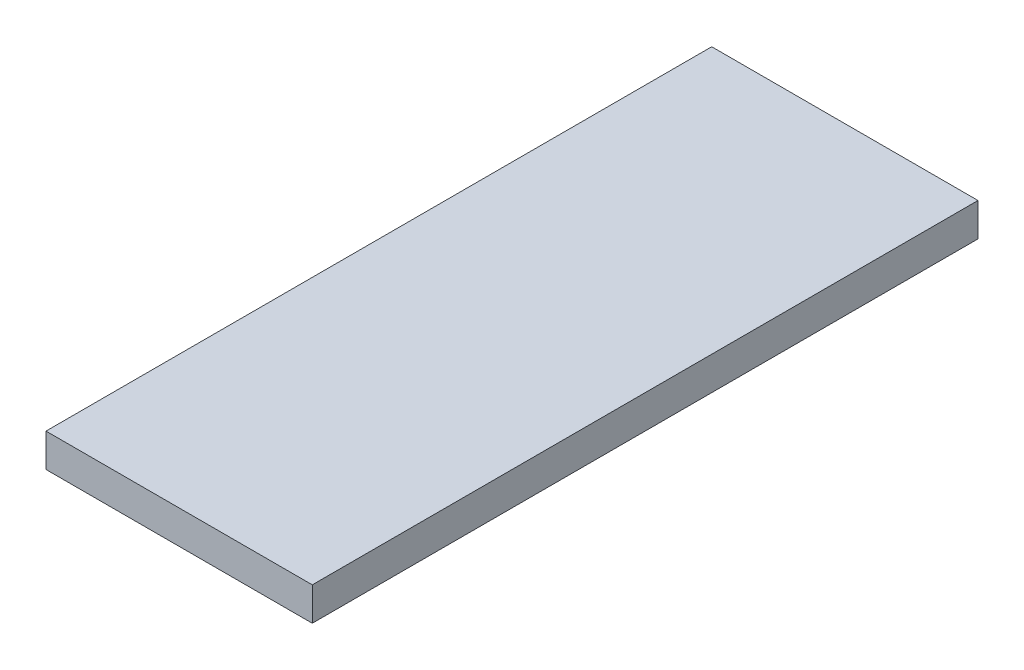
from build123d import *

# Parameters (mm, degrees)
SKIZZE1_W               = 40
SKIZZE1_H               = 5
LINEAR_AUSTRAGEN1_DEPTH = 50


with BuildPart() as part:
    # Skizze1 → Linear austragen1 (new, symmetric)
    with BuildSketch(Plane.XY):
        Rectangle(SKIZZE1_W, SKIZZE1_H)
    extrude(amount=LINEAR_AUSTRAGEN1_DEPTH, both=True)


solid = part.part
